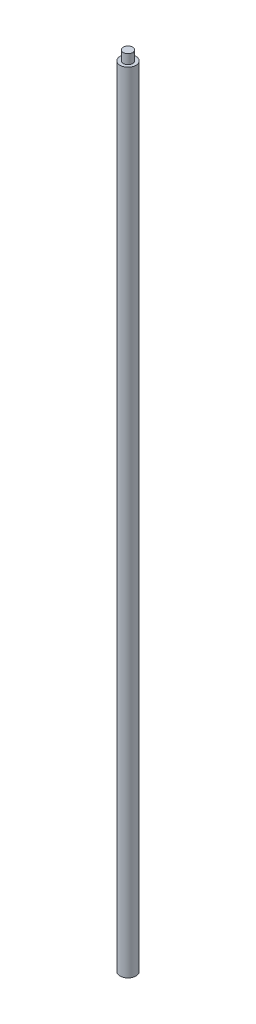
ISO-10303-21;
HEADER;
FILE_DESCRIPTION(('STEP AP214'),'2;1');
FILE_NAME('part.step','',(''),(''),'','','');
FILE_SCHEMA(('AUTOMOTIVE_DESIGN { 1 0 10303 214 1 1 1 1 }'));
ENDSEC;
DATA;
#1=APPLICATION_CONTEXT('core data for automotive mechanical design processes');
#2=APPLICATION_PROTOCOL_DEFINITION('international standard','automotive_design',2000,#1);
#3=PRODUCT_CONTEXT('',#1,'mechanical');
#4=PRODUCT('Part','Part','',(#3));
#5=PRODUCT_RELATED_PRODUCT_CATEGORY('part','',(#4));
#6=PRODUCT_DEFINITION_FORMATION('','',#4);
#7=PRODUCT_DEFINITION_CONTEXT('part definition',#1,'design');
#8=PRODUCT_DEFINITION('design','',#6,#7);
#9=PRODUCT_DEFINITION_SHAPE('','',#8);
#10=(LENGTH_UNIT() NAMED_UNIT(*) SI_UNIT(.MILLI.,.METRE.));
#11=(NAMED_UNIT(*) PLANE_ANGLE_UNIT() SI_UNIT($,.RADIAN.));
#12=(NAMED_UNIT(*) SI_UNIT($,.STERADIAN.) SOLID_ANGLE_UNIT());
#13=UNCERTAINTY_MEASURE_WITH_UNIT(LENGTH_MEASURE(1.E-05),#10,'distance_accuracy_value','');
#14=(GEOMETRIC_REPRESENTATION_CONTEXT(3) GLOBAL_UNCERTAINTY_ASSIGNED_CONTEXT((#13)) GLOBAL_UNIT_ASSIGNED_CONTEXT((#10,
#11,#12)) REPRESENTATION_CONTEXT('',''));
#15=CARTESIAN_POINT('',(0.,0.,0.));
#16=DIRECTION('',(0.,0.,1.));
#17=DIRECTION('',(1.,0.,0.));
#18=AXIS2_PLACEMENT_3D('',#15,#16,#17);
#19=CARTESIAN_POINT('',(0.,250.,0.));
#20=DIRECTION('',(0.,1.,0.));
#21=DIRECTION('',(0.,0.,1.));
#22=AXIS2_PLACEMENT_3D('',#19,#20,#21);
#23=PLANE('',#22);
#24=CARTESIAN_POINT('',(0.,250.,0.));
#25=DIRECTION('',(0.,1.,0.));
#26=DIRECTION('',(0.,0.,1.));
#27=AXIS2_PLACEMENT_3D('',#24,#25,#26);
#28=CIRCLE('',#27,2.5);
#29=CARTESIAN_POINT('',(0.,250.,2.5));
#30=VERTEX_POINT('',#29);
#31=EDGE_CURVE('E10',#30,#30,#28,.T.);
#32=ORIENTED_EDGE('',*,*,#31,.T.);
#33=EDGE_LOOP('',(#32));
#34=FACE_BOUND('',#33,.T.);
#35=CARTESIAN_POINT('',(0.,250.,0.));
#36=DIRECTION('',(0.,1.,0.));
#37=DIRECTION('',(0.,0.,1.));
#38=AXIS2_PLACEMENT_3D('',#35,#36,#37);
#39=CIRCLE('',#38,1.5);
#40=CARTESIAN_POINT('',(0.,250.,1.5));
#41=VERTEX_POINT('',#40);
#42=EDGE_CURVE('E43',#41,#41,#39,.T.);
#43=ORIENTED_EDGE('',*,*,#42,.F.);
#44=EDGE_LOOP('',(#43));
#45=FACE_BOUND('',#44,.T.);
#46=ADVANCED_FACE('F28',(#34,#45),#23,.T.);
#47=CARTESIAN_POINT('',(0.,250.,0.));
#48=DIRECTION('',(0.,-1.,0.));
#49=DIRECTION('',(0.,0.,-1.));
#50=AXIS2_PLACEMENT_3D('',#47,#48,#49);
#51=CYLINDRICAL_SURFACE('',#50,2.5);
#52=ORIENTED_EDGE('',*,*,#31,.F.);
#53=EDGE_LOOP('',(#52));
#54=FACE_BOUND('',#53,.T.);
#55=CARTESIAN_POINT('',(0.,0.,0.));
#56=DIRECTION('',(0.,1.,0.));
#57=DIRECTION('',(0.,0.,1.));
#58=AXIS2_PLACEMENT_3D('',#55,#56,#57);
#59=CIRCLE('',#58,2.5);
#60=CARTESIAN_POINT('',(0.,0.,2.5));
#61=VERTEX_POINT('',#60);
#62=EDGE_CURVE('E35',#61,#61,#59,.T.);
#63=ORIENTED_EDGE('',*,*,#62,.T.);
#64=EDGE_LOOP('',(#63));
#65=FACE_BOUND('',#64,.T.);
#66=ADVANCED_FACE('F30',(#54,#65),#51,.T.);
#67=CARTESIAN_POINT('',(0.,0.,0.));
#68=DIRECTION('',(0.,1.,0.));
#69=DIRECTION('',(0.,0.,1.));
#70=AXIS2_PLACEMENT_3D('',#67,#68,#69);
#71=PLANE('',#70);
#72=ORIENTED_EDGE('',*,*,#62,.F.);
#73=EDGE_LOOP('',(#72));
#74=FACE_BOUND('',#73,.T.);
#75=ADVANCED_FACE('F55',(#74),#71,.F.);
#76=CARTESIAN_POINT('',(0.,253.,0.));
#77=DIRECTION('',(0.,-1.,0.));
#78=DIRECTION('',(0.,0.,-1.));
#79=AXIS2_PLACEMENT_3D('',#76,#77,#78);
#80=CYLINDRICAL_SURFACE('',#79,1.5);
#81=CARTESIAN_POINT('',(0.,253.,0.));
#82=DIRECTION('',(0.,1.,0.));
#83=DIRECTION('',(0.,0.,1.));
#84=AXIS2_PLACEMENT_3D('',#81,#82,#83);
#85=CIRCLE('',#84,1.5);
#86=CARTESIAN_POINT('',(0.,253.,1.5));
#87=VERTEX_POINT('',#86);
#88=EDGE_CURVE('E39',#87,#87,#85,.T.);
#89=ORIENTED_EDGE('',*,*,#88,.F.);
#90=EDGE_LOOP('',(#89));
#91=FACE_BOUND('',#90,.T.);
#92=ORIENTED_EDGE('',*,*,#42,.T.);
#93=EDGE_LOOP('',(#92));
#94=FACE_BOUND('',#93,.T.);
#95=ADVANCED_FACE('F49',(#91,#94),#80,.T.);
#96=CARTESIAN_POINT('',(0.,253.,0.));
#97=DIRECTION('',(0.,1.,0.));
#98=DIRECTION('',(0.,0.,1.));
#99=AXIS2_PLACEMENT_3D('',#96,#97,#98);
#100=PLANE('',#99);
#101=ORIENTED_EDGE('',*,*,#88,.T.);
#102=EDGE_LOOP('',(#101));
#103=FACE_BOUND('',#102,.T.);
#104=ADVANCED_FACE('F63',(#103),#100,.T.);
#105=CLOSED_SHELL('',(#46,#66,#75,#95,#104));
#106=MANIFOLD_SOLID_BREP('B2',#105);
#107=ADVANCED_BREP_SHAPE_REPRESENTATION('',(#18,#106),#14);
#108=SHAPE_DEFINITION_REPRESENTATION(#9,#107);
ENDSEC;
END-ISO-10303-21;
